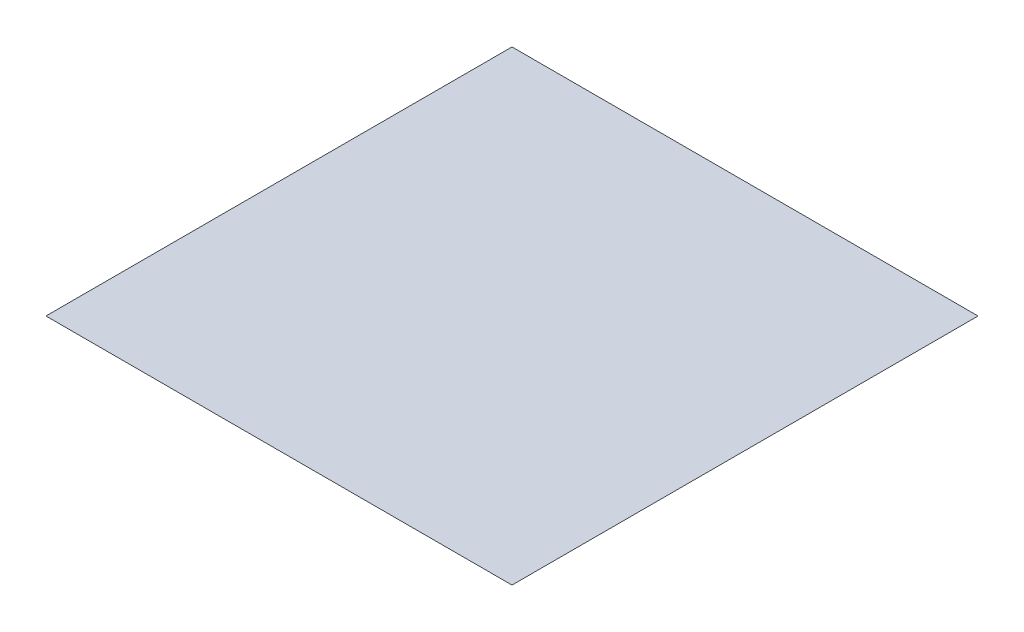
ISO-10303-21;
HEADER;
FILE_DESCRIPTION(('STEP AP214'),'2;1');
FILE_NAME('part.step','',(''),(''),'','','');
FILE_SCHEMA(('AUTOMOTIVE_DESIGN { 1 0 10303 214 1 1 1 1 }'));
ENDSEC;
DATA;
#1=APPLICATION_CONTEXT('core data for automotive mechanical design processes');
#2=APPLICATION_PROTOCOL_DEFINITION('international standard','automotive_design',2000,#1);
#3=PRODUCT_CONTEXT('',#1,'mechanical');
#4=PRODUCT('Part','Part','',(#3));
#5=PRODUCT_RELATED_PRODUCT_CATEGORY('part','',(#4));
#6=PRODUCT_DEFINITION_FORMATION('','',#4);
#7=PRODUCT_DEFINITION_CONTEXT('part definition',#1,'design');
#8=PRODUCT_DEFINITION('design','',#6,#7);
#9=PRODUCT_DEFINITION_SHAPE('','',#8);
#10=(LENGTH_UNIT() NAMED_UNIT(*) SI_UNIT(.MILLI.,.METRE.));
#11=(NAMED_UNIT(*) PLANE_ANGLE_UNIT() SI_UNIT($,.RADIAN.));
#12=(NAMED_UNIT(*) SI_UNIT($,.STERADIAN.) SOLID_ANGLE_UNIT());
#13=UNCERTAINTY_MEASURE_WITH_UNIT(LENGTH_MEASURE(1.E-05),#10,'distance_accuracy_value','');
#14=(GEOMETRIC_REPRESENTATION_CONTEXT(3) GLOBAL_UNCERTAINTY_ASSIGNED_CONTEXT((#13)) GLOBAL_UNIT_ASSIGNED_CONTEXT((#10,
#11,#12)) REPRESENTATION_CONTEXT('',''));
#15=CARTESIAN_POINT('',(0.,0.,0.));
#16=DIRECTION('',(0.,0.,1.));
#17=DIRECTION('',(1.,0.,0.));
#18=AXIS2_PLACEMENT_3D('',#15,#16,#17);
#19=CARTESIAN_POINT('',(-50.,0.,50.));
#20=DIRECTION('',(0.,1.,0.));
#21=DIRECTION('',(0.,0.,1.));
#22=AXIS2_PLACEMENT_3D('',#19,#20,#21);
#23=PLANE('',#22);
#24=DIRECTION('',(1.,0.,0.));
#25=VECTOR('',#24,1.);
#26=CARTESIAN_POINT('',(-50.,0.,50.));
#27=LINE('',#26,#25);
#28=CARTESIAN_POINT('',(-49.9748893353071,0.,50.));
#29=VERTEX_POINT('',#28);
#30=CARTESIAN_POINT('',(49.9748893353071,0.,50.));
#31=VERTEX_POINT('',#30);
#32=EDGE_CURVE('E93',#29,#31,#27,.T.);
#33=ORIENTED_EDGE('',*,*,#32,.T.);
#34=CARTESIAN_POINT('',(43.7474320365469,0.,43.7474320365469));
#35=DIRECTION('',(0.,1.,0.));
#36=DIRECTION('',(-0.707106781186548,0.,-0.707106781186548));
#37=AXIS2_PLACEMENT_3D('',#34,#35,#36);
#38=ELLIPSE('',#37,8.83358399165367,0.39624);
#39=CARTESIAN_POINT('',(50.,0.,49.9748893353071));
#40=VERTEX_POINT('',#39);
#41=EDGE_CURVE('E88',#31,#40,#38,.T.);
#42=ORIENTED_EDGE('',*,*,#41,.T.);
#43=DIRECTION('',(0.,0.,-1.));
#44=VECTOR('',#43,1.);
#45=CARTESIAN_POINT('',(50.,0.,-50.));
#46=LINE('',#45,#44);
#47=CARTESIAN_POINT('',(50.,0.,-49.9748893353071));
#48=VERTEX_POINT('',#47);
#49=EDGE_CURVE('E90',#40,#48,#46,.T.);
#50=ORIENTED_EDGE('',*,*,#49,.T.);
#51=CARTESIAN_POINT('',(43.7474320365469,0.,-43.7474320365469));
#52=DIRECTION('',(0.,1.,0.));
#53=DIRECTION('',(-0.707106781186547,0.,0.707106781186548));
#54=AXIS2_PLACEMENT_3D('',#51,#52,#53);
#55=ELLIPSE('',#54,8.83358399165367,0.39624);
#56=CARTESIAN_POINT('',(49.9748893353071,0.,-50.));
#57=VERTEX_POINT('',#56);
#58=EDGE_CURVE('E118',#48,#57,#55,.T.);
#59=ORIENTED_EDGE('',*,*,#58,.T.);
#60=DIRECTION('',(-1.,0.,0.));
#61=VECTOR('',#60,1.);
#62=CARTESIAN_POINT('',(-50.,0.,-50.));
#63=LINE('',#62,#61);
#64=CARTESIAN_POINT('',(-49.9748893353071,0.,-50.));
#65=VERTEX_POINT('',#64);
#66=EDGE_CURVE('E105',#57,#65,#63,.T.);
#67=ORIENTED_EDGE('',*,*,#66,.T.);
#68=CARTESIAN_POINT('',(-43.7474320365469,0.,-43.7474320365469));
#69=DIRECTION('',(0.,1.,0.));
#70=DIRECTION('',(0.707106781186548,0.,0.707106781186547));
#71=AXIS2_PLACEMENT_3D('',#68,#69,#70);
#72=ELLIPSE('',#71,8.83358399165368,0.39624);
#73=CARTESIAN_POINT('',(-50.,0.,-49.9748893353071));
#74=VERTEX_POINT('',#73);
#75=EDGE_CURVE('E120',#65,#74,#72,.T.);
#76=ORIENTED_EDGE('',*,*,#75,.T.);
#77=DIRECTION('',(0.,0.,1.));
#78=VECTOR('',#77,1.);
#79=CARTESIAN_POINT('',(-50.,0.,-50.));
#80=LINE('',#79,#78);
#81=CARTESIAN_POINT('',(-50.,0.,49.9748893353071));
#82=VERTEX_POINT('',#81);
#83=EDGE_CURVE('E134',#74,#82,#80,.T.);
#84=ORIENTED_EDGE('',*,*,#83,.T.);
#85=CARTESIAN_POINT('',(-43.7474320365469,0.,43.7474320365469));
#86=DIRECTION('',(0.,1.,0.));
#87=DIRECTION('',(0.707106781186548,0.,-0.707106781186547));
#88=AXIS2_PLACEMENT_3D('',#85,#86,#87);
#89=ELLIPSE('',#88,8.83358399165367,0.39624);
#90=EDGE_CURVE('E97',#82,#29,#89,.T.);
#91=ORIENTED_EDGE('',*,*,#90,.T.);
#92=EDGE_LOOP('',(#33,#42,#50,#59,#67,#76,#84,#91));
#93=FACE_BOUND('',#92,.T.);
#94=ADVANCED_FACE('F32',(#93),#23,.T.);
#95=CARTESIAN_POINT('',(0.,-3.175,0.));
#96=DIRECTION('',(0.0633723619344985,0.997989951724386,0.));
#97=DIRECTION('',(-0.997989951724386,0.0633723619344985,0.));
#98=AXIS2_PLACEMENT_3D('',#95,#96,#97);
#99=PLANE('',#98);
#100=DIRECTION('',(0.70639504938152,-0.0448560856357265,0.70639504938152));
#101=VECTOR('',#100,1.);
#102=CARTESIAN_POINT('',(-0.0125300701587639,-3.17420434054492,0.0125805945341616));
#103=LINE('',#102,#101);
#104=CARTESIAN_POINT('',(-0.0251106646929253,-3.173405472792,0.));
#105=VERTEX_POINT('',#104);
#106=EDGE_CURVE('E55',#74,#105,#103,.T.);
#107=ORIENTED_EDGE('',*,*,#106,.T.);
#108=DIRECTION('',(0.70639504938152,-0.0448560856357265,-0.70639504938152));
#109=VECTOR('',#108,1.);
#110=CARTESIAN_POINT('',(-0.0125300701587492,-3.17420434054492,-0.0125805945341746));
#111=LINE('',#110,#109);
#112=EDGE_CURVE('E124',#105,#82,#111,.F.);
#113=ORIENTED_EDGE('',*,*,#112,.T.);
#114=ORIENTED_EDGE('',*,*,#83,.F.);
#115=EDGE_LOOP('',(#107,#113,#114));
#116=FACE_BOUND('',#115,.T.);
#117=ADVANCED_FACE('F154',(#116),#99,.F.);
#118=CARTESIAN_POINT('',(0.,-3.175,0.));
#119=DIRECTION('',(0.,0.997989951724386,-0.0633723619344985));
#120=DIRECTION('',(0.,0.0633723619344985,0.997989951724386));
#121=AXIS2_PLACEMENT_3D('',#118,#119,#120);
#122=PLANE('',#121);
#123=DIRECTION('',(0.70639504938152,-0.0448560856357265,-0.70639504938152));
#124=VECTOR('',#123,1.);
#125=CARTESIAN_POINT('',(0.0125805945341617,-3.17420434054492,0.012530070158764));
#126=LINE('',#125,#124);
#127=CARTESIAN_POINT('',(0.,-3.173405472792,0.0251106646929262));
#128=VERTEX_POINT('',#127);
#129=EDGE_CURVE('E111',#29,#128,#126,.T.);
#130=ORIENTED_EDGE('',*,*,#129,.T.);
#131=DIRECTION('',(-0.70639504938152,-0.0448560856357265,-0.70639504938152));
#132=VECTOR('',#131,1.);
#133=CARTESIAN_POINT('',(-0.0125805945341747,-3.17420434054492,0.0125300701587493));
#134=LINE('',#133,#132);
#135=EDGE_CURVE('E113',#128,#31,#134,.F.);
#136=ORIENTED_EDGE('',*,*,#135,.T.);
#137=ORIENTED_EDGE('',*,*,#32,.F.);
#138=EDGE_LOOP('',(#130,#136,#137));
#139=FACE_BOUND('',#138,.T.);
#140=ADVANCED_FACE('F151',(#139),#122,.F.);
#141=CARTESIAN_POINT('',(0.,-3.175,0.));
#142=DIRECTION('',(0.,0.997989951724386,0.0633723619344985));
#143=DIRECTION('',(0.,-0.0633723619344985,0.997989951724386));
#144=AXIS2_PLACEMENT_3D('',#141,#142,#143);
#145=PLANE('',#144);
#146=DIRECTION('',(-0.70639504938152,-0.0448560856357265,0.70639504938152));
#147=VECTOR('',#146,1.);
#148=CARTESIAN_POINT('',(-0.0125805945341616,-3.17420434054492,-0.0125300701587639));
#149=LINE('',#148,#147);
#150=CARTESIAN_POINT('',(0.,-3.173405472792,-0.0251106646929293));
#151=VERTEX_POINT('',#150);
#152=EDGE_CURVE('E41',#57,#151,#149,.T.);
#153=ORIENTED_EDGE('',*,*,#152,.T.);
#154=DIRECTION('',(0.70639504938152,-0.0448560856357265,0.70639504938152));
#155=VECTOR('',#154,1.);
#156=CARTESIAN_POINT('',(0.0125805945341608,-3.17420434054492,-0.0125300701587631));
#157=LINE('',#156,#155);
#158=EDGE_CURVE('E12',#151,#65,#157,.F.);
#159=ORIENTED_EDGE('',*,*,#158,.T.);
#160=ORIENTED_EDGE('',*,*,#66,.F.);
#161=EDGE_LOOP('',(#153,#159,#160));
#162=FACE_BOUND('',#161,.T.);
#163=ADVANCED_FACE('F153',(#162),#145,.F.);
#164=CARTESIAN_POINT('',(0.,-3.175,0.));
#165=DIRECTION('',(-0.0633723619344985,0.997989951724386,0.));
#166=DIRECTION('',(-0.997989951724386,-0.0633723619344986,0.));
#167=AXIS2_PLACEMENT_3D('',#164,#165,#166);
#168=PLANE('',#167);
#169=ORIENTED_EDGE('',*,*,#49,.F.);
#170=DIRECTION('',(-0.70639504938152,-0.0448560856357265,-0.70639504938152));
#171=VECTOR('',#170,1.);
#172=CARTESIAN_POINT('',(0.0125300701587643,-3.17420434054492,-0.0125805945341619));
#173=LINE('',#172,#171);
#174=CARTESIAN_POINT('',(0.0251106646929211,-3.173405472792,0.));
#175=VERTEX_POINT('',#174);
#176=EDGE_CURVE('E102',#40,#175,#173,.T.);
#177=ORIENTED_EDGE('',*,*,#176,.T.);
#178=DIRECTION('',(-0.70639504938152,-0.0448560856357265,0.70639504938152));
#179=VECTOR('',#178,1.);
#180=CARTESIAN_POINT('',(0.0125300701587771,-3.17420434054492,0.012580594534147));
#181=LINE('',#180,#179);
#182=EDGE_CURVE('E104',#175,#48,#181,.F.);
#183=ORIENTED_EDGE('',*,*,#182,.T.);
#184=EDGE_LOOP('',(#169,#177,#183));
#185=FACE_BOUND('',#184,.T.);
#186=ADVANCED_FACE('F101',(#185),#168,.F.);
#187=CARTESIAN_POINT('',(-0.0125805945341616,-2.77876080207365,0.0125805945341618));
#188=DIRECTION('',(-0.70639504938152,-0.0448560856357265,0.70639504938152));
#189=DIRECTION('',(0.707106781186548,0.,0.707106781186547));
#190=AXIS2_PLACEMENT_3D('',#187,#188,#189);
#191=CYLINDRICAL_SURFACE('',#190,0.39624);
#192=ORIENTED_EDGE('',*,*,#58,.F.);
#193=ORIENTED_EDGE('',*,*,#182,.F.);
#194=CARTESIAN_POINT('',(0.,-2.77796193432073,0.));
#195=DIRECTION('',(-0.706395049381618,-0.0448560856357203,0.706395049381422));
#196=DIRECTION('',(0.70710678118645,0.,0.707106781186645));
#197=AXIS2_PLACEMENT_3D('',#194,#195,#196);
#198=CIRCLE('',#197,0.39624);
#199=EDGE_CURVE('E36',#151,#175,#198,.T.);
#200=ORIENTED_EDGE('',*,*,#199,.F.);
#201=ORIENTED_EDGE('',*,*,#152,.F.);
#202=EDGE_LOOP('',(#192,#193,#200,#201));
#203=FACE_BOUND('',#202,.T.);
#204=ADVANCED_FACE('F34',(#203),#191,.T.);
#205=CARTESIAN_POINT('',(0.0125805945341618,-2.77876080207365,0.0125805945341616));
#206=DIRECTION('',(0.70639504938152,-0.0448560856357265,0.70639504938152));
#207=DIRECTION('',(0.707106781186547,0.,-0.707106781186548));
#208=AXIS2_PLACEMENT_3D('',#205,#206,#207);
#209=CYLINDRICAL_SURFACE('',#208,0.39624);
#210=ORIENTED_EDGE('',*,*,#75,.F.);
#211=ORIENTED_EDGE('',*,*,#158,.F.);
#212=CARTESIAN_POINT('',(0.,-2.77796193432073,0.));
#213=DIRECTION('',(0.706395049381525,-0.0448560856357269,0.706395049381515));
#214=DIRECTION('',(0.707106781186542,0.,-0.707106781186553));
#215=AXIS2_PLACEMENT_3D('',#212,#213,#214);
#216=CIRCLE('',#215,0.39624);
#217=EDGE_CURVE('E130',#105,#151,#216,.T.);
#218=ORIENTED_EDGE('',*,*,#217,.F.);
#219=ORIENTED_EDGE('',*,*,#106,.F.);
#220=EDGE_LOOP('',(#210,#211,#218,#219));
#221=FACE_BOUND('',#220,.T.);
#222=ADVANCED_FACE('F144',(#221),#209,.T.);
#223=CARTESIAN_POINT('',(0.0125805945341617,-2.77876080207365,-0.0125805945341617));
#224=DIRECTION('',(0.70639504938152,-0.0448560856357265,-0.70639504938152));
#225=DIRECTION('',(-0.707106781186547,0.,-0.707106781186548));
#226=AXIS2_PLACEMENT_3D('',#223,#224,#225);
#227=CYLINDRICAL_SURFACE('',#226,0.39624);
#228=ORIENTED_EDGE('',*,*,#90,.F.);
#229=ORIENTED_EDGE('',*,*,#112,.F.);
#230=CARTESIAN_POINT('',(0.,-2.77796193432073,0.));
#231=DIRECTION('',(0.706395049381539,-0.0448560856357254,-0.706395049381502));
#232=DIRECTION('',(-0.707106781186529,0.,-0.707106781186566));
#233=AXIS2_PLACEMENT_3D('',#230,#231,#232);
#234=CIRCLE('',#233,0.39624);
#235=EDGE_CURVE('E128',#128,#105,#234,.T.);
#236=ORIENTED_EDGE('',*,*,#235,.F.);
#237=ORIENTED_EDGE('',*,*,#129,.F.);
#238=EDGE_LOOP('',(#228,#229,#236,#237));
#239=FACE_BOUND('',#238,.T.);
#240=ADVANCED_FACE('F149',(#239),#227,.T.);
#241=CARTESIAN_POINT('',(0.,-2.77796193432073,0.));
#242=DIRECTION('',(0.,0.,1.));
#243=DIRECTION('',(1.,0.,0.));
#244=AXIS2_PLACEMENT_3D('',#241,#242,#243);
#245=SPHERICAL_SURFACE('',#244,0.39624);
#246=ORIENTED_EDGE('',*,*,#217,.T.);
#247=ORIENTED_EDGE('',*,*,#199,.T.);
#248=CARTESIAN_POINT('',(0.,-2.77796193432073,0.));
#249=DIRECTION('',(-0.706395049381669,-0.044856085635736,-0.706395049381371));
#250=DIRECTION('',(-0.707106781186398,0.,0.707106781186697));
#251=AXIS2_PLACEMENT_3D('',#248,#249,#250);
#252=CIRCLE('',#251,0.39624);
#253=EDGE_CURVE('E109',#128,#175,#252,.F.);
#254=ORIENTED_EDGE('',*,*,#253,.F.);
#255=ORIENTED_EDGE('',*,*,#235,.T.);
#256=EDGE_LOOP('',(#246,#247,#254,#255));
#257=FACE_BOUND('',#256,.T.);
#258=ADVANCED_FACE('F146',(#257),#245,.T.);
#259=CARTESIAN_POINT('',(-0.0125805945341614,-2.77876080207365,-0.0125805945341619));
#260=DIRECTION('',(-0.70639504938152,-0.0448560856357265,-0.70639504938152));
#261=DIRECTION('',(-0.707106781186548,0.,0.707106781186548));
#262=AXIS2_PLACEMENT_3D('',#259,#260,#261);
#263=CYLINDRICAL_SURFACE('',#262,0.39624);
#264=ORIENTED_EDGE('',*,*,#41,.F.);
#265=ORIENTED_EDGE('',*,*,#135,.F.);
#266=ORIENTED_EDGE('',*,*,#253,.T.);
#267=ORIENTED_EDGE('',*,*,#176,.F.);
#268=EDGE_LOOP('',(#264,#265,#266,#267));
#269=FACE_BOUND('',#268,.T.);
#270=ADVANCED_FACE('F107',(#269),#263,.T.);
#271=CLOSED_SHELL('',(#94,#117,#140,#163,#186,#204,#222,#240,#258,#270));
#272=MANIFOLD_SOLID_BREP('B2',#271);
#273=ADVANCED_BREP_SHAPE_REPRESENTATION('',(#18,#272),#14);
#274=SHAPE_DEFINITION_REPRESENTATION(#9,#273);
ENDSEC;
END-ISO-10303-21;
